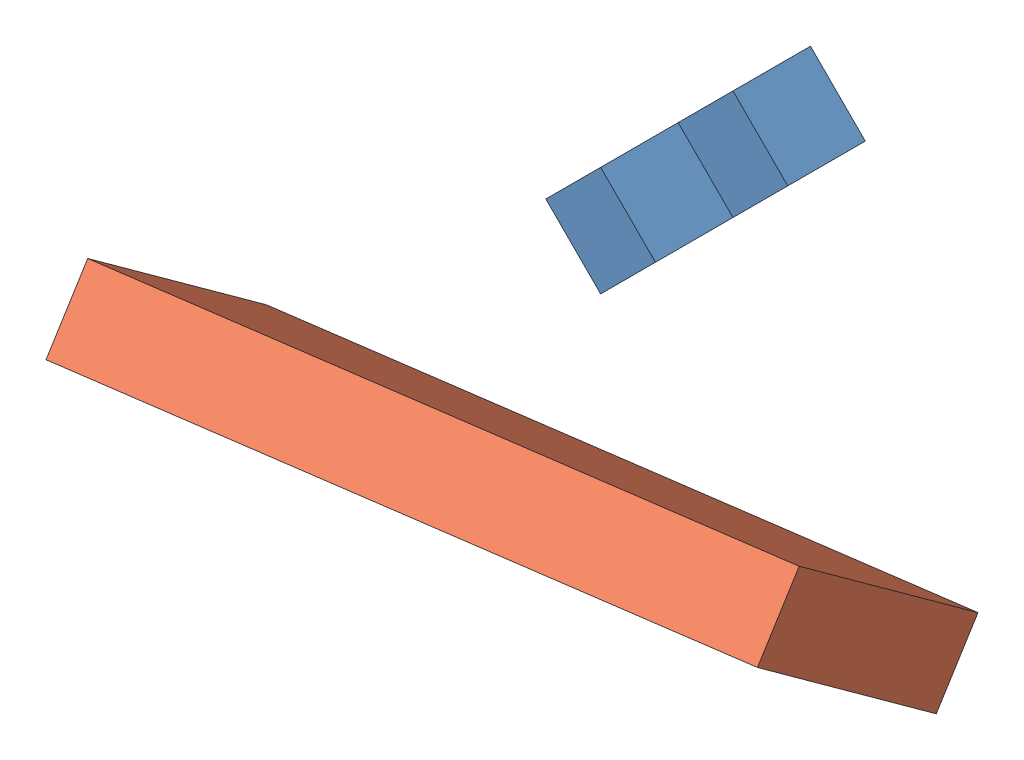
SolidWorks assembly Ensamblaje1.SLDASM, configuration Predeterminado (file format 4400). Lengths in mm.
Overall size (173.01 144.85 126.31).
2 component instances, 2 part files, 0 mates.
Components (placement in the parent):
- Pieza1-1: Pieza1.SLDPRT [Predeterminado] at (17.2629 -6.7513 0) size (56.57 56.57 40)
- Pieza2-1: Pieza2.SLDPRT [Predeterminado] at (-26.6418 -80.5225 69.3469) x (0.957165 -0.113109 -0.266537) z (0.278383 0.612617 0.739732) size (150 20 100)
